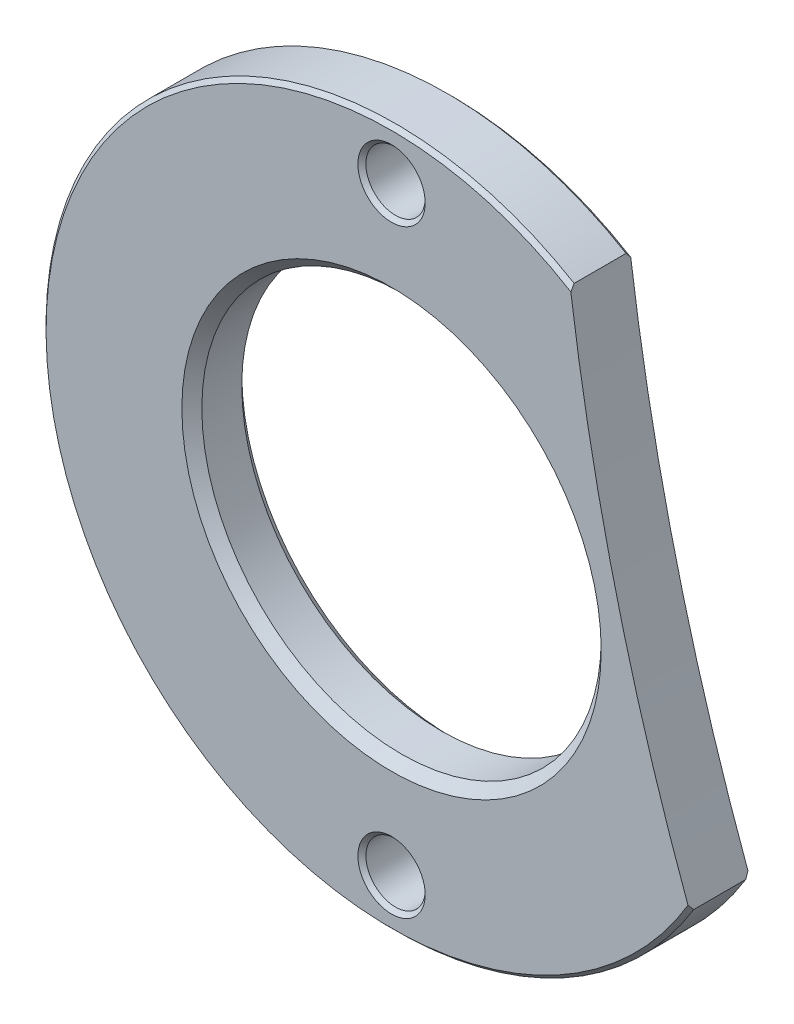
from build123d import *

# Parameters (mm, degrees)
ESQUISSE1_R                     = 10
BOSS_EXTRU_1_DEPTH              = 3
DIAM_TRE_DU_PER_AGE_2_9_2_9_1_D = 2.97
CHANFREIN1_SIZE                 = 0.5
CHANFREIN2_SIZE                 = 0.2
CHANFREIN3_SIZE                 = 0.5
CHANFREIN4_SIZE                 = 0.2


with BuildPart() as part:
    # Esquisse1 → Boss.-Extru.1 (new body)
    with BuildSketch(Plane.XY):
        with BuildLine():
            ThreePointArc((8.945791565, 15.040705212), (-16.985856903, -4.210779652), (14.935356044, -9.120588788))
            ThreePointArc((14.935356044, -9.120588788), (11.261136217, 2.791626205), (8.945791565, 15.040705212))
        make_face()
        Circle(ESQUISSE1_R, mode=Mode.SUBTRACT)
    extrude(amount=BOSS_EXTRU_1_DEPTH)

    # Diam_tre du per_age _2.9 _2.9_1 (through all)
    with Locations(Plane.XY.offset(3)):
        with Locations((0, 15), (0, -15)):
            Hole(DIAM_TRE_DU_PER_AGE_2_9_2_9_1_D / 2)

    # Chanfrein1
    chanfrein1_edges = [part.edges().sort_by_distance(p)[0] for p in [
        (-10, 0, 0),
    ]]
    chamfer(chanfrein1_edges, length=CHANFREIN1_SIZE)

    # Chanfrein2
    chanfrein2_edges = [part.edges().sort_by_distance(p)[0] for p in [
        (-16.985856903, -4.210779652, 0),
        (-16.985856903, -4.210779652, 3),
    ]]
    chamfer(chanfrein2_edges, length=CHANFREIN2_SIZE)

    # Chanfrein3
    chanfrein3_edges = [part.edges().sort_by_distance(p)[0] for p in [
        (-10, 0, 3),
    ]]
    chamfer(chanfrein3_edges, length=CHANFREIN3_SIZE)

    # Chanfrein4
    chanfrein4_edges = [part.edges().sort_by_distance(p)[0] for p in [
        (1.485, -15, 3),
        (1.485, -15, 0),
        (1.485, 15, 3),
        (1.485, 15, 0),
    ]]
    chamfer(chanfrein4_edges, length=CHANFREIN4_SIZE)


solid = part.part
